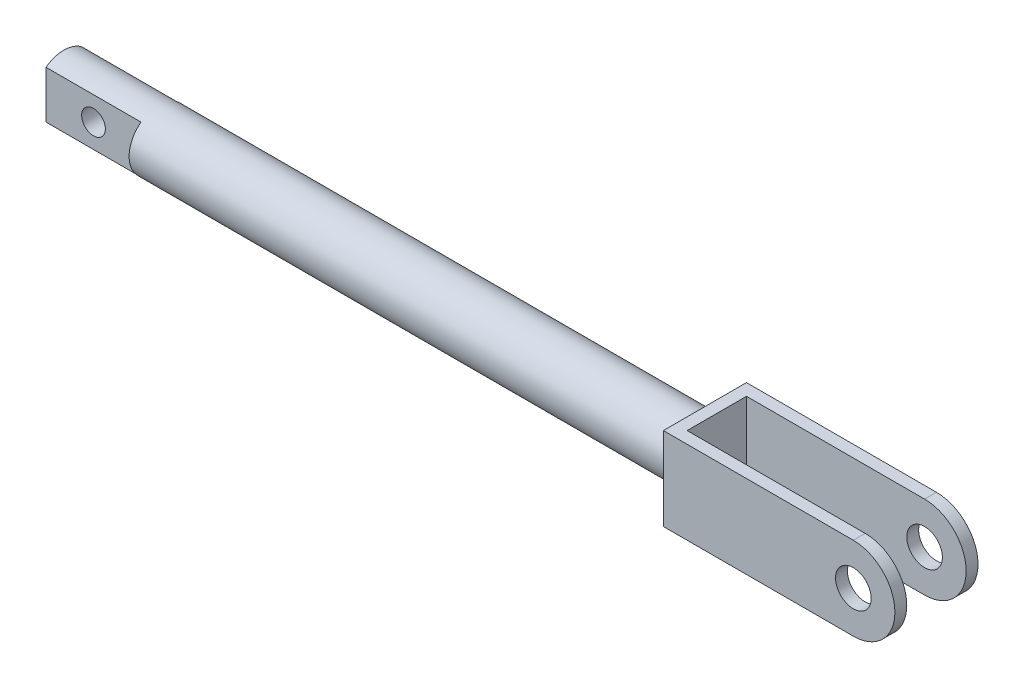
ISO-10303-21;
HEADER;
FILE_DESCRIPTION(('STEP AP214'),'2;1');
FILE_NAME('part.step','',(''),(''),'','','');
FILE_SCHEMA(('AUTOMOTIVE_DESIGN { 1 0 10303 214 1 1 1 1 }'));
ENDSEC;
DATA;
#1=APPLICATION_CONTEXT('core data for automotive mechanical design processes');
#2=APPLICATION_PROTOCOL_DEFINITION('international standard','automotive_design',2000,#1);
#3=PRODUCT_CONTEXT('',#1,'mechanical');
#4=PRODUCT('Part','Part','',(#3));
#5=PRODUCT_RELATED_PRODUCT_CATEGORY('part','',(#4));
#6=PRODUCT_DEFINITION_FORMATION('','',#4);
#7=PRODUCT_DEFINITION_CONTEXT('part definition',#1,'design');
#8=PRODUCT_DEFINITION('design','',#6,#7);
#9=PRODUCT_DEFINITION_SHAPE('','',#8);
#10=(LENGTH_UNIT() NAMED_UNIT(*) SI_UNIT(.MILLI.,.METRE.));
#11=(NAMED_UNIT(*) PLANE_ANGLE_UNIT() SI_UNIT($,.RADIAN.));
#12=(NAMED_UNIT(*) SI_UNIT($,.STERADIAN.) SOLID_ANGLE_UNIT());
#13=UNCERTAINTY_MEASURE_WITH_UNIT(LENGTH_MEASURE(1.E-05),#10,'distance_accuracy_value','');
#14=(GEOMETRIC_REPRESENTATION_CONTEXT(3) GLOBAL_UNCERTAINTY_ASSIGNED_CONTEXT((#13)) GLOBAL_UNIT_ASSIGNED_CONTEXT((#10,
#11,#12)) REPRESENTATION_CONTEXT('',''));
#15=CARTESIAN_POINT('',(0.,0.,0.));
#16=DIRECTION('',(0.,0.,1.));
#17=DIRECTION('',(1.,0.,0.));
#18=AXIS2_PLACEMENT_3D('',#15,#16,#17);
#19=CARTESIAN_POINT('',(330.,0.,17.5));
#20=DIRECTION('',(0.,0.,-0.999999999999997));
#21=DIRECTION('',(-1.,0.,0.));
#22=AXIS2_PLACEMENT_3D('',#19,#20,#21);
#23=CYLINDRICAL_SURFACE('',#22,17.5);
#24=DIRECTION('',(0.,0.,-0.999999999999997));
#25=VECTOR('',#24,1.);
#26=CARTESIAN_POINT('',(330.,17.5000000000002,17.5));
#27=LINE('',#26,#25);
#28=CARTESIAN_POINT('',(330.,17.5,-12.5));
#29=VERTEX_POINT('',#28);
#30=CARTESIAN_POINT('',(330.,17.5000000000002,-17.5));
#31=VERTEX_POINT('',#30);
#32=EDGE_CURVE('E211',#29,#31,#27,.T.);
#33=ORIENTED_EDGE('',*,*,#32,.F.);
#34=CARTESIAN_POINT('',(330.,0.,-12.5));
#35=DIRECTION('',(0.,0.,-0.999999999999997));
#36=DIRECTION('',(-1.,0.,0.));
#37=AXIS2_PLACEMENT_3D('',#34,#35,#36);
#38=CIRCLE('',#37,17.5);
#39=CARTESIAN_POINT('',(330.,-17.5,-12.5));
#40=VERTEX_POINT('',#39);
#41=EDGE_CURVE('E176',#29,#40,#38,.T.);
#42=ORIENTED_EDGE('',*,*,#41,.T.);
#43=DIRECTION('',(0.,0.,-0.999999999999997));
#44=VECTOR('',#43,1.);
#45=CARTESIAN_POINT('',(330.,-17.5,17.5));
#46=LINE('',#45,#44);
#47=CARTESIAN_POINT('',(330.,-17.5,-17.4999999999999));
#48=VERTEX_POINT('',#47);
#49=EDGE_CURVE('E215',#40,#48,#46,.T.);
#50=ORIENTED_EDGE('',*,*,#49,.T.);
#51=CARTESIAN_POINT('',(330.,0.,-17.5));
#52=DIRECTION('',(0.,0.,0.999999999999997));
#53=DIRECTION('',(-1.,0.,0.));
#54=AXIS2_PLACEMENT_3D('',#51,#52,#53);
#55=CIRCLE('',#54,17.5);
#56=EDGE_CURVE('E199',#48,#31,#55,.T.);
#57=ORIENTED_EDGE('',*,*,#56,.T.);
#58=EDGE_LOOP('',(#33,#42,#50,#57));
#59=FACE_BOUND('',#58,.T.);
#60=ADVANCED_FACE('F45',(#59),#23,.T.);
#61=CARTESIAN_POINT('',(330.,0.,17.5));
#62=DIRECTION('',(0.,0.,-0.999999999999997));
#63=DIRECTION('',(-1.,0.,0.));
#64=AXIS2_PLACEMENT_3D('',#61,#62,#63);
#65=CYLINDRICAL_SURFACE('',#64,7.50000000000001);
#66=CARTESIAN_POINT('',(330.,0.,-12.5));
#67=DIRECTION('',(0.,0.,-0.999999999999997));
#68=DIRECTION('',(-1.,0.,0.));
#69=AXIS2_PLACEMENT_3D('',#66,#67,#68);
#70=CIRCLE('',#69,7.50000000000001);
#71=CARTESIAN_POINT('',(322.5,0.,-12.5));
#72=VERTEX_POINT('',#71);
#73=EDGE_CURVE('E175',#72,#72,#70,.T.);
#74=CARTESIAN_POINT('',(330.,0.,-17.5));
#75=DIRECTION('',(0.,0.,0.999999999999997));
#76=DIRECTION('',(1.,0.,0.));
#77=AXIS2_PLACEMENT_3D('',#74,#75,#76);
#78=CIRCLE('',#77,7.50000000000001);
#79=CARTESIAN_POINT('',(322.5,0.,-17.5));
#80=VERTEX_POINT('',#79);
#81=EDGE_CURVE('E185',#80,#80,#78,.T.);
#82=CARTESIAN_POINT('',(322.5,0.,-12.5));
#83=CARTESIAN_POINT('',(322.5,0.,-12.5520833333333));
#84=CARTESIAN_POINT('',(322.5,0.,-12.6041666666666));
#85=CARTESIAN_POINT('',(322.5,0.,-12.7083333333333));
#86=CARTESIAN_POINT('',(322.5,0.,-12.7604166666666));
#87=CARTESIAN_POINT('',(322.5,0.,-12.8645833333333));
#88=CARTESIAN_POINT('',(322.5,0.,-12.9166666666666));
#89=CARTESIAN_POINT('',(322.5,0.,-13.0208333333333));
#90=CARTESIAN_POINT('',(322.5,0.,-13.0729166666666));
#91=CARTESIAN_POINT('',(322.5,0.,-13.1770833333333));
#92=CARTESIAN_POINT('',(322.5,0.,-13.2291666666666));
#93=CARTESIAN_POINT('',(322.5,0.,-13.3333333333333));
#94=CARTESIAN_POINT('',(322.5,0.,-13.3854166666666));
#95=CARTESIAN_POINT('',(322.5,0.,-13.4895833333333));
#96=CARTESIAN_POINT('',(322.5,0.,-13.5416666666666));
#97=CARTESIAN_POINT('',(322.5,0.,-13.6458333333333));
#98=CARTESIAN_POINT('',(322.5,0.,-13.6979166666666));
#99=CARTESIAN_POINT('',(322.5,0.,-13.8020833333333));
#100=CARTESIAN_POINT('',(322.5,0.,-13.8541666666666));
#101=CARTESIAN_POINT('',(322.5,0.,-13.9583333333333));
#102=CARTESIAN_POINT('',(322.5,0.,-14.0104166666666));
#103=CARTESIAN_POINT('',(322.5,0.,-14.1145833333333));
#104=CARTESIAN_POINT('',(322.5,0.,-14.1666666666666));
#105=CARTESIAN_POINT('',(322.5,0.,-14.2708333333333));
#106=CARTESIAN_POINT('',(322.5,0.,-14.3229166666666));
#107=CARTESIAN_POINT('',(322.5,0.,-14.4270833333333));
#108=CARTESIAN_POINT('',(322.5,0.,-14.4791666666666));
#109=CARTESIAN_POINT('',(322.5,0.,-14.5833333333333));
#110=CARTESIAN_POINT('',(322.5,0.,-14.6354166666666));
#111=CARTESIAN_POINT('',(322.5,0.,-14.7395833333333));
#112=CARTESIAN_POINT('',(322.5,0.,-14.7916666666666));
#113=CARTESIAN_POINT('',(322.5,0.,-14.8958333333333));
#114=CARTESIAN_POINT('',(322.5,0.,-14.9479166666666));
#115=CARTESIAN_POINT('',(322.5,0.,-15.0520833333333));
#116=CARTESIAN_POINT('',(322.5,0.,-15.1041666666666));
#117=CARTESIAN_POINT('',(322.5,0.,-15.2083333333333));
#118=CARTESIAN_POINT('',(322.5,0.,-15.2604166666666));
#119=CARTESIAN_POINT('',(322.5,0.,-15.3645833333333));
#120=CARTESIAN_POINT('',(322.5,0.,-15.4166666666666));
#121=CARTESIAN_POINT('',(322.5,0.,-15.5208333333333));
#122=CARTESIAN_POINT('',(322.5,0.,-15.5729166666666));
#123=CARTESIAN_POINT('',(322.5,0.,-15.6770833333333));
#124=CARTESIAN_POINT('',(322.5,0.,-15.7291666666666));
#125=CARTESIAN_POINT('',(322.5,0.,-15.8333333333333));
#126=CARTESIAN_POINT('',(322.5,0.,-15.8854166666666));
#127=CARTESIAN_POINT('',(322.5,0.,-15.9895833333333));
#128=CARTESIAN_POINT('',(322.5,0.,-16.0416666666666));
#129=CARTESIAN_POINT('',(322.5,0.,-16.1458333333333));
#130=CARTESIAN_POINT('',(322.5,0.,-16.1979166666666));
#131=CARTESIAN_POINT('',(322.5,0.,-16.3020833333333));
#132=CARTESIAN_POINT('',(322.5,0.,-16.3541666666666));
#133=CARTESIAN_POINT('',(322.5,0.,-16.4583333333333));
#134=CARTESIAN_POINT('',(322.5,0.,-16.5104166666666));
#135=CARTESIAN_POINT('',(322.5,0.,-16.6145833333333));
#136=CARTESIAN_POINT('',(322.5,0.,-16.6666666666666));
#137=CARTESIAN_POINT('',(322.5,0.,-16.7708333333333));
#138=CARTESIAN_POINT('',(322.5,0.,-16.8229166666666));
#139=CARTESIAN_POINT('',(322.5,0.,-16.9270833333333));
#140=CARTESIAN_POINT('',(322.5,0.,-16.9791666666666));
#141=CARTESIAN_POINT('',(322.5,0.,-17.0833333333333));
#142=CARTESIAN_POINT('',(322.5,0.,-17.1354166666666));
#143=CARTESIAN_POINT('',(322.5,0.,-17.2395833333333));
#144=CARTESIAN_POINT('',(322.5,0.,-17.2916666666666));
#145=CARTESIAN_POINT('',(322.5,0.,-17.3958333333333));
#146=CARTESIAN_POINT('',(322.5,0.,-17.4479166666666));
#147=CARTESIAN_POINT('',(322.5,0.,-17.5));
#148=B_SPLINE_CURVE_WITH_KNOTS('',3,(#82,#83,#84,#85,#86,#87,#88,#89,#90,#91,#92,#93,#94,#95,
#96,#97,#98,#99,#100,#101,#102,#103,#104,#105,#106,#107,#108,#109,#110,#111,#112,#113,#114,#115,
#116,#117,#118,#119,#120,#121,#122,#123,#124,#125,#126,#127,#128,#129,#130,#131,#132,#133,#134,
#135,#136,#137,#138,#139,#140,#141,#142,#143,#144,#145,#146,#147),.UNSPECIFIED.,.F.,.F.,(4,2,2,
2,2,2,2,2,2,2,2,2,2,2,2,2,2,2,2,2,2,2,2,2,2,2,2,2,2,2,2,2,4),(0.,0.15625,0.3125,0.46875,
0.624999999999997,0.781250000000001,0.937500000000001,1.09375,1.25,1.40625,1.5625,1.71875,
1.87500000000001,2.03125,2.18750000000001,2.34375,2.50000000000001,2.65625,2.8125,2.96875,3.125,
3.28125,3.4375,3.59375,3.75000000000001,3.90625,4.06250000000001,4.21875,4.37500000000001,
4.53125,4.68750000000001,4.84375000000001,5.00000000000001),.UNSPECIFIED.);
#149=EDGE_CURVE('BSEAM258',#72,#80,#148,.T.);
#150=ORIENTED_EDGE('',*,*,#73,.F.);
#151=ORIENTED_EDGE('',*,*,#81,.F.);
#152=ORIENTED_EDGE('',*,*,#149,.T.);
#153=ORIENTED_EDGE('',*,*,#149,.F.);
#154=EDGE_LOOP('',(#150,#152,#151,#153));
#155=FACE_BOUND('',#154,.T.);
#156=ADVANCED_FACE('F258',(#155),#65,.F.);
#157=CARTESIAN_POINT('',(250.,0.,0.));
#158=DIRECTION('',(-1.,0.,0.));
#159=DIRECTION('',(0.,0.,0.999999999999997));
#160=AXIS2_PLACEMENT_3D('',#157,#158,#159);
#161=CYLINDRICAL_SURFACE('',#160,12.5);
#162=CARTESIAN_POINT('',(250.,0.,0.));
#163=DIRECTION('',(1.,0.,0.));
#164=DIRECTION('',(0.,0.,-0.999999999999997));
#165=AXIS2_PLACEMENT_3D('',#162,#163,#164);
#166=CIRCLE('',#165,12.5);
#167=CARTESIAN_POINT('',(250.,0.,-12.5));
#168=VERTEX_POINT('',#167);
#169=EDGE_CURVE('E226',#168,#168,#166,.T.);
#170=ORIENTED_EDGE('',*,*,#169,.F.);
#171=EDGE_LOOP('',(#170));
#172=FACE_BOUND('',#171,.T.);
#173=CARTESIAN_POINT('',(-20.0000000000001,0.,0.));
#174=DIRECTION('',(1.,0.,0.));
#175=DIRECTION('',(0.,0.,-0.999999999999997));
#176=AXIS2_PLACEMENT_3D('',#173,#174,#175);
#177=CIRCLE('',#176,12.5);
#178=CARTESIAN_POINT('',(-20.,10.,-7.49999999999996));
#179=VERTEX_POINT('',#178);
#180=CARTESIAN_POINT('',(-20.,10.,7.5));
#181=VERTEX_POINT('',#180);
#182=EDGE_CURVE('E147',#179,#181,#177,.T.);
#183=ORIENTED_EDGE('',*,*,#182,.T.);
#184=DIRECTION('',(-1.,0.,0.));
#185=VECTOR('',#184,1.);
#186=CARTESIAN_POINT('',(250.,10.,7.50000000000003));
#187=LINE('',#186,#185);
#188=CARTESIAN_POINT('',(20.,10.,7.50000000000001));
#189=VERTEX_POINT('',#188);
#190=EDGE_CURVE('E60',#181,#189,#187,.F.);
#191=ORIENTED_EDGE('',*,*,#190,.T.);
#192=CARTESIAN_POINT('',(20.,0.,0.));
#193=DIRECTION('',(1.,0.,0.));
#194=DIRECTION('',(0.,0.,-0.999999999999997));
#195=AXIS2_PLACEMENT_3D('',#192,#193,#194);
#196=CIRCLE('',#195,12.5);
#197=CARTESIAN_POINT('',(20.,-10.,7.50000000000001));
#198=VERTEX_POINT('',#197);
#199=EDGE_CURVE('E13',#189,#198,#196,.T.);
#200=ORIENTED_EDGE('',*,*,#199,.T.);
#201=DIRECTION('',(-1.,0.,0.));
#202=VECTOR('',#201,1.);
#203=CARTESIAN_POINT('',(250.,-9.9999999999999,7.50000000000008));
#204=LINE('',#203,#202);
#205=CARTESIAN_POINT('',(-20.0000000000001,-9.99999999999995,7.49999999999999));
#206=VERTEX_POINT('',#205);
#207=EDGE_CURVE('E134',#198,#206,#204,.T.);
#208=ORIENTED_EDGE('',*,*,#207,.T.);
#209=CARTESIAN_POINT('',(-20.0000000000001,-9.99999999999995,-7.49999999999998));
#210=VERTEX_POINT('',#209);
#211=EDGE_CURVE('E68',#206,#210,#177,.T.);
#212=ORIENTED_EDGE('',*,*,#211,.T.);
#213=DIRECTION('',(-1.,0.,0.));
#214=VECTOR('',#213,1.);
#215=CARTESIAN_POINT('',(250.,-9.9999999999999,-7.50000000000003));
#216=LINE('',#215,#214);
#217=CARTESIAN_POINT('',(20.,-9.99999999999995,-7.5));
#218=VERTEX_POINT('',#217);
#219=EDGE_CURVE('E181',#210,#218,#216,.F.);
#220=ORIENTED_EDGE('',*,*,#219,.T.);
#221=CARTESIAN_POINT('',(20.,0.,0.));
#222=DIRECTION('',(1.,0.,0.));
#223=DIRECTION('',(0.,0.,-0.999999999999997));
#224=AXIS2_PLACEMENT_3D('',#221,#222,#223);
#225=CIRCLE('',#224,12.5);
#226=CARTESIAN_POINT('',(20.,10.,-7.49999999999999));
#227=VERTEX_POINT('',#226);
#228=EDGE_CURVE('E232',#218,#227,#225,.T.);
#229=ORIENTED_EDGE('',*,*,#228,.T.);
#230=DIRECTION('',(-1.,0.,0.));
#231=VECTOR('',#230,1.);
#232=CARTESIAN_POINT('',(250.,10.,-7.50000000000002));
#233=LINE('',#232,#231);
#234=EDGE_CURVE('E183',#227,#179,#233,.T.);
#235=ORIENTED_EDGE('',*,*,#234,.T.);
#236=EDGE_LOOP('',(#183,#191,#200,#208,#212,#220,#229,#235));
#237=FACE_BOUND('',#236,.T.);
#238=ADVANCED_FACE('F47',(#172,#237),#161,.T.);
#239=CARTESIAN_POINT('',(-20.0000000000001,0.,0.));
#240=DIRECTION('',(1.,0.,0.));
#241=DIRECTION('',(0.,0.,-0.999999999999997));
#242=AXIS2_PLACEMENT_3D('',#239,#240,#241);
#243=PLANE('',#242);
#244=ORIENTED_EDGE('',*,*,#211,.F.);
#245=DIRECTION('',(0.,1.,0.));
#246=VECTOR('',#245,1.);
#247=CARTESIAN_POINT('',(-20.0000000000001,0.,7.5));
#248=LINE('',#247,#246);
#249=EDGE_CURVE('E53',#206,#181,#248,.T.);
#250=ORIENTED_EDGE('',*,*,#249,.T.);
#251=ORIENTED_EDGE('',*,*,#182,.F.);
#252=DIRECTION('',(0.,-1.,0.));
#253=VECTOR('',#252,1.);
#254=CARTESIAN_POINT('',(-20.0000000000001,0.,-7.49999999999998));
#255=LINE('',#254,#253);
#256=EDGE_CURVE('E229',#179,#210,#255,.T.);
#257=ORIENTED_EDGE('',*,*,#256,.T.);
#258=EDGE_LOOP('',(#244,#250,#251,#257));
#259=FACE_BOUND('',#258,.T.);
#260=ADVANCED_FACE('F238',(#259),#243,.F.);
#261=CARTESIAN_POINT('',(250.,17.5000000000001,17.4999999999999));
#262=DIRECTION('',(1.,0.,0.));
#263=DIRECTION('',(0.,0.,-0.999999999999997));
#264=AXIS2_PLACEMENT_3D('',#261,#262,#263);
#265=PLANE('',#264);
#266=DIRECTION('',(0.,-1.,0.));
#267=VECTOR('',#266,1.);
#268=CARTESIAN_POINT('',(250.,17.5000000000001,-17.5));
#269=LINE('',#268,#267);
#270=CARTESIAN_POINT('',(250.,17.5000000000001,-17.5));
#271=VERTEX_POINT('',#270);
#272=CARTESIAN_POINT('',(250.,-17.5,-17.5));
#273=VERTEX_POINT('',#272);
#274=EDGE_CURVE('E194',#271,#273,#269,.T.);
#275=ORIENTED_EDGE('',*,*,#274,.T.);
#276=DIRECTION('',(0.,0.,-0.999999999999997));
#277=VECTOR('',#276,1.);
#278=CARTESIAN_POINT('',(250.,-17.5,17.5));
#279=LINE('',#278,#277);
#280=CARTESIAN_POINT('',(250.,-17.5,17.5));
#281=VERTEX_POINT('',#280);
#282=EDGE_CURVE('E219',#281,#273,#279,.T.);
#283=ORIENTED_EDGE('',*,*,#282,.F.);
#284=DIRECTION('',(0.,-1.,0.));
#285=VECTOR('',#284,1.);
#286=CARTESIAN_POINT('',(250.,17.5000000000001,17.4999999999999));
#287=LINE('',#286,#285);
#288=CARTESIAN_POINT('',(250.,17.5000000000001,17.4999999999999));
#289=VERTEX_POINT('',#288);
#290=EDGE_CURVE('E205',#289,#281,#287,.T.);
#291=ORIENTED_EDGE('',*,*,#290,.F.);
#292=DIRECTION('',(0.,0.,-0.999999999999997));
#293=VECTOR('',#292,1.);
#294=CARTESIAN_POINT('',(250.,17.5000000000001,17.4999999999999));
#295=LINE('',#294,#293);
#296=EDGE_CURVE('E222',#289,#271,#295,.T.);
#297=ORIENTED_EDGE('',*,*,#296,.T.);
#298=EDGE_LOOP('',(#275,#283,#291,#297));
#299=FACE_BOUND('',#298,.T.);
#300=ORIENTED_EDGE('',*,*,#169,.T.);
#301=EDGE_LOOP('',(#300));
#302=FACE_BOUND('',#301,.T.);
#303=ADVANCED_FACE('F308',(#299,#302),#265,.F.);
#304=CARTESIAN_POINT('',(330.,0.,17.5));
#305=DIRECTION('',(0.,0.,-0.999999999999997));
#306=DIRECTION('',(-1.,0.,0.));
#307=AXIS2_PLACEMENT_3D('',#304,#305,#306);
#308=PLANE('',#307);
#309=DIRECTION('',(-1.,0.,0.));
#310=VECTOR('',#309,1.);
#311=CARTESIAN_POINT('',(250.,17.5000000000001,17.4999999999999));
#312=LINE('',#311,#310);
#313=CARTESIAN_POINT('',(330.,17.5000000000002,17.5));
#314=VERTEX_POINT('',#313);
#315=EDGE_CURVE('E202',#314,#289,#312,.T.);
#316=ORIENTED_EDGE('',*,*,#315,.T.);
#317=ORIENTED_EDGE('',*,*,#290,.T.);
#318=DIRECTION('',(1.,0.,0.));
#319=VECTOR('',#318,1.);
#320=CARTESIAN_POINT('',(330.,-17.5,17.5));
#321=LINE('',#320,#319);
#322=CARTESIAN_POINT('',(330.,-17.5,17.5));
#323=VERTEX_POINT('',#322);
#324=EDGE_CURVE('E207',#281,#323,#321,.T.);
#325=ORIENTED_EDGE('',*,*,#324,.T.);
#326=CARTESIAN_POINT('',(330.,0.,17.5));
#327=DIRECTION('',(0.,0.,0.999999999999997));
#328=DIRECTION('',(-1.,0.,0.));
#329=AXIS2_PLACEMENT_3D('',#326,#327,#328);
#330=CIRCLE('',#329,17.5);
#331=EDGE_CURVE('E209',#323,#314,#330,.T.);
#332=ORIENTED_EDGE('',*,*,#331,.T.);
#333=EDGE_LOOP('',(#316,#317,#325,#332));
#334=FACE_BOUND('',#333,.T.);
#335=CARTESIAN_POINT('',(330.,0.,17.5));
#336=DIRECTION('',(0.,0.,0.999999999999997));
#337=DIRECTION('',(1.,0.,0.));
#338=AXIS2_PLACEMENT_3D('',#335,#336,#337);
#339=CIRCLE('',#338,7.50000000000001);
#340=CARTESIAN_POINT('',(322.5,0.,17.5));
#341=VERTEX_POINT('',#340);
#342=EDGE_CURVE('E188',#341,#341,#339,.T.);
#343=ORIENTED_EDGE('',*,*,#342,.F.);
#344=EDGE_LOOP('',(#343));
#345=FACE_BOUND('',#344,.T.);
#346=ADVANCED_FACE('F290',(#334,#345),#308,.F.);
#347=CARTESIAN_POINT('',(330.,0.,-17.5));
#348=DIRECTION('',(0.,0.,-0.999999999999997));
#349=DIRECTION('',(-1.,0.,0.));
#350=AXIS2_PLACEMENT_3D('',#347,#348,#349);
#351=PLANE('',#350);
#352=DIRECTION('',(-1.,0.,0.));
#353=VECTOR('',#352,1.);
#354=CARTESIAN_POINT('',(250.,17.5000000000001,-17.5));
#355=LINE('',#354,#353);
#356=EDGE_CURVE('E191',#31,#271,#355,.T.);
#357=ORIENTED_EDGE('',*,*,#356,.F.);
#358=ORIENTED_EDGE('',*,*,#56,.F.);
#359=DIRECTION('',(1.,0.,0.));
#360=VECTOR('',#359,1.);
#361=CARTESIAN_POINT('',(330.,-17.5,-17.4999999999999));
#362=LINE('',#361,#360);
#363=EDGE_CURVE('E196',#273,#48,#362,.T.);
#364=ORIENTED_EDGE('',*,*,#363,.F.);
#365=ORIENTED_EDGE('',*,*,#274,.F.);
#366=EDGE_LOOP('',(#357,#358,#364,#365));
#367=FACE_BOUND('',#366,.T.);
#368=ORIENTED_EDGE('',*,*,#81,.T.);
#369=EDGE_LOOP('',(#368));
#370=FACE_BOUND('',#369,.T.);
#371=ADVANCED_FACE('F305',(#367,#370),#351,.T.);
#372=CARTESIAN_POINT('',(250.,17.5000000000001,17.4999999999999));
#373=DIRECTION('',(0.,-1.,0.));
#374=DIRECTION('',(1.,0.,0.));
#375=AXIS2_PLACEMENT_3D('',#372,#373,#374);
#376=PLANE('',#375);
#377=DIRECTION('',(0.,0.,0.999999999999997));
#378=VECTOR('',#377,1.);
#379=CARTESIAN_POINT('',(255.000000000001,17.5000000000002,-12.5));
#380=LINE('',#379,#378);
#381=CARTESIAN_POINT('',(255.000000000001,17.5000000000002,-12.5));
#382=VERTEX_POINT('',#381);
#383=CARTESIAN_POINT('',(255.000000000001,17.5000000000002,12.5));
#384=VERTEX_POINT('',#383);
#385=EDGE_CURVE('E155',#382,#384,#380,.T.);
#386=ORIENTED_EDGE('',*,*,#385,.F.);
#387=DIRECTION('',(-1.,0.,0.));
#388=VECTOR('',#387,1.);
#389=CARTESIAN_POINT('',(330.,17.5,-12.5));
#390=LINE('',#389,#388);
#391=EDGE_CURVE('E153',#29,#382,#390,.T.);
#392=ORIENTED_EDGE('',*,*,#391,.F.);
#393=ORIENTED_EDGE('',*,*,#32,.T.);
#394=ORIENTED_EDGE('',*,*,#356,.T.);
#395=ORIENTED_EDGE('',*,*,#296,.F.);
#396=ORIENTED_EDGE('',*,*,#315,.F.);
#397=CARTESIAN_POINT('',(330.,17.5,12.5));
#398=VERTEX_POINT('',#397);
#399=EDGE_CURVE('E212',#314,#398,#27,.T.);
#400=ORIENTED_EDGE('',*,*,#399,.T.);
#401=DIRECTION('',(1.,0.,0.));
#402=VECTOR('',#401,1.);
#403=CARTESIAN_POINT('',(330.,17.5,12.5));
#404=LINE('',#403,#402);
#405=EDGE_CURVE('E138',#384,#398,#404,.T.);
#406=ORIENTED_EDGE('',*,*,#405,.F.);
#407=EDGE_LOOP('',(#386,#392,#393,#394,#395,#396,#400,#406));
#408=FACE_BOUND('',#407,.T.);
#409=ADVANCED_FACE('F276',(#408),#376,.F.);
#410=CARTESIAN_POINT('',(330.,-17.5,17.5));
#411=DIRECTION('',(0.,1.,0.));
#412=DIRECTION('',(-1.,0.,0.));
#413=AXIS2_PLACEMENT_3D('',#410,#411,#412);
#414=PLANE('',#413);
#415=ORIENTED_EDGE('',*,*,#49,.F.);
#416=DIRECTION('',(-1.,0.,0.));
#417=VECTOR('',#416,1.);
#418=CARTESIAN_POINT('',(347.5,-17.5,-12.5));
#419=LINE('',#418,#417);
#420=CARTESIAN_POINT('',(255.,-17.5,-12.5));
#421=VERTEX_POINT('',#420);
#422=EDGE_CURVE('E161',#40,#421,#419,.T.);
#423=ORIENTED_EDGE('',*,*,#422,.T.);
#424=DIRECTION('',(0.,0.,0.999999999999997));
#425=VECTOR('',#424,1.);
#426=CARTESIAN_POINT('',(255.,-17.5,-12.5));
#427=LINE('',#426,#425);
#428=CARTESIAN_POINT('',(255.,-17.5,12.5));
#429=VERTEX_POINT('',#428);
#430=EDGE_CURVE('E164',#421,#429,#427,.T.);
#431=ORIENTED_EDGE('',*,*,#430,.T.);
#432=DIRECTION('',(1.,0.,0.));
#433=VECTOR('',#432,1.);
#434=CARTESIAN_POINT('',(255.,-17.5,12.5));
#435=LINE('',#434,#433);
#436=CARTESIAN_POINT('',(330.,-17.5,12.5));
#437=VERTEX_POINT('',#436);
#438=EDGE_CURVE('E158',#429,#437,#435,.T.);
#439=ORIENTED_EDGE('',*,*,#438,.T.);
#440=EDGE_CURVE('E216',#323,#437,#46,.T.);
#441=ORIENTED_EDGE('',*,*,#440,.F.);
#442=ORIENTED_EDGE('',*,*,#324,.F.);
#443=ORIENTED_EDGE('',*,*,#282,.T.);
#444=ORIENTED_EDGE('',*,*,#363,.T.);
#445=EDGE_LOOP('',(#415,#423,#431,#439,#441,#442,#443,#444));
#446=FACE_BOUND('',#445,.T.);
#447=ADVANCED_FACE('F271',(#446),#414,.F.);
#448=CARTESIAN_POINT('',(330.,0.,12.5));
#449=DIRECTION('',(0.,0.,0.999999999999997));
#450=DIRECTION('',(1.,0.,0.));
#451=AXIS2_PLACEMENT_3D('',#448,#449,#450);
#452=CIRCLE('',#451,17.5);
#453=EDGE_CURVE('E173',#437,#398,#452,.T.);
#454=ORIENTED_EDGE('',*,*,#453,.T.);
#455=ORIENTED_EDGE('',*,*,#399,.F.);
#456=ORIENTED_EDGE('',*,*,#331,.F.);
#457=ORIENTED_EDGE('',*,*,#440,.T.);
#458=EDGE_LOOP('',(#454,#455,#456,#457));
#459=FACE_BOUND('',#458,.T.);
#460=ADVANCED_FACE('F255',(#459),#23,.T.);
#461=CARTESIAN_POINT('',(330.,0.,12.5));
#462=DIRECTION('',(0.,0.,0.999999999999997));
#463=DIRECTION('',(1.,0.,0.));
#464=AXIS2_PLACEMENT_3D('',#461,#462,#463);
#465=CIRCLE('',#464,7.50000000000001);
#466=CARTESIAN_POINT('',(322.5,0.,12.5));
#467=VERTEX_POINT('',#466);
#468=EDGE_CURVE('E170',#467,#467,#465,.T.);
#469=CARTESIAN_POINT('',(322.5,0.,12.5));
#470=CARTESIAN_POINT('',(322.5,0.,12.5520833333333));
#471=CARTESIAN_POINT('',(322.5,0.,12.6041666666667));
#472=CARTESIAN_POINT('',(322.5,0.,12.7083333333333));
#473=CARTESIAN_POINT('',(322.5,0.,12.7604166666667));
#474=CARTESIAN_POINT('',(322.5,0.,12.8645833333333));
#475=CARTESIAN_POINT('',(322.5,0.,12.9166666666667));
#476=CARTESIAN_POINT('',(322.5,0.,13.0208333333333));
#477=CARTESIAN_POINT('',(322.5,0.,13.0729166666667));
#478=CARTESIAN_POINT('',(322.5,0.,13.1770833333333));
#479=CARTESIAN_POINT('',(322.5,0.,13.2291666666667));
#480=CARTESIAN_POINT('',(322.5,0.,13.3333333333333));
#481=CARTESIAN_POINT('',(322.5,0.,13.3854166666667));
#482=CARTESIAN_POINT('',(322.5,0.,13.4895833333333));
#483=CARTESIAN_POINT('',(322.5,0.,13.5416666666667));
#484=CARTESIAN_POINT('',(322.5,0.,13.6458333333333));
#485=CARTESIAN_POINT('',(322.5,0.,13.6979166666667));
#486=CARTESIAN_POINT('',(322.5,0.,13.8020833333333));
#487=CARTESIAN_POINT('',(322.5,0.,13.8541666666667));
#488=CARTESIAN_POINT('',(322.5,0.,13.9583333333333));
#489=CARTESIAN_POINT('',(322.5,0.,14.0104166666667));
#490=CARTESIAN_POINT('',(322.5,0.,14.1145833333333));
#491=CARTESIAN_POINT('',(322.5,0.,14.1666666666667));
#492=CARTESIAN_POINT('',(322.5,0.,14.2708333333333));
#493=CARTESIAN_POINT('',(322.5,0.,14.3229166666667));
#494=CARTESIAN_POINT('',(322.5,0.,14.4270833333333));
#495=CARTESIAN_POINT('',(322.5,0.,14.4791666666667));
#496=CARTESIAN_POINT('',(322.5,0.,14.5833333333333));
#497=CARTESIAN_POINT('',(322.5,0.,14.6354166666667));
#498=CARTESIAN_POINT('',(322.5,0.,14.7395833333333));
#499=CARTESIAN_POINT('',(322.5,0.,14.7916666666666));
#500=CARTESIAN_POINT('',(322.5,0.,14.8958333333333));
#501=CARTESIAN_POINT('',(322.5,0.,14.9479166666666));
#502=CARTESIAN_POINT('',(322.5,0.,15.0520833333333));
#503=CARTESIAN_POINT('',(322.5,0.,15.1041666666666));
#504=CARTESIAN_POINT('',(322.5,0.,15.2083333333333));
#505=CARTESIAN_POINT('',(322.5,0.,15.2604166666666));
#506=CARTESIAN_POINT('',(322.5,0.,15.3645833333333));
#507=CARTESIAN_POINT('',(322.5,0.,15.4166666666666));
#508=CARTESIAN_POINT('',(322.5,0.,15.5208333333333));
#509=CARTESIAN_POINT('',(322.5,0.,15.5729166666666));
#510=CARTESIAN_POINT('',(322.5,0.,15.6770833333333));
#511=CARTESIAN_POINT('',(322.5,0.,15.7291666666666));
#512=CARTESIAN_POINT('',(322.5,0.,15.8333333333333));
#513=CARTESIAN_POINT('',(322.5,0.,15.8854166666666));
#514=CARTESIAN_POINT('',(322.5,0.,15.9895833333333));
#515=CARTESIAN_POINT('',(322.5,0.,16.0416666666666));
#516=CARTESIAN_POINT('',(322.5,0.,16.1458333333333));
#517=CARTESIAN_POINT('',(322.5,0.,16.1979166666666));
#518=CARTESIAN_POINT('',(322.5,0.,16.3020833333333));
#519=CARTESIAN_POINT('',(322.5,0.,16.3541666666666));
#520=CARTESIAN_POINT('',(322.5,0.,16.4583333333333));
#521=CARTESIAN_POINT('',(322.5,0.,16.5104166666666));
#522=CARTESIAN_POINT('',(322.5,0.,16.6145833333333));
#523=CARTESIAN_POINT('',(322.5,0.,16.6666666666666));
#524=CARTESIAN_POINT('',(322.5,0.,16.7708333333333));
#525=CARTESIAN_POINT('',(322.5,0.,16.8229166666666));
#526=CARTESIAN_POINT('',(322.5,0.,16.9270833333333));
#527=CARTESIAN_POINT('',(322.5,0.,16.9791666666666));
#528=CARTESIAN_POINT('',(322.5,0.,17.0833333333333));
#529=CARTESIAN_POINT('',(322.5,0.,17.1354166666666));
#530=CARTESIAN_POINT('',(322.5,0.,17.2395833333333));
#531=CARTESIAN_POINT('',(322.5,0.,17.2916666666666));
#532=CARTESIAN_POINT('',(322.5,0.,17.3958333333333));
#533=CARTESIAN_POINT('',(322.5,0.,17.4479166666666));
#534=CARTESIAN_POINT('',(322.5,0.,17.5));
#535=B_SPLINE_CURVE_WITH_KNOTS('',3,(#469,#470,#471,#472,#473,#474,#475,#476,#477,#478,#479,
#480,#481,#482,#483,#484,#485,#486,#487,#488,#489,#490,#491,#492,#493,#494,#495,#496,#497,#498,
#499,#500,#501,#502,#503,#504,#505,#506,#507,#508,#509,#510,#511,#512,#513,#514,#515,#516,#517,
#518,#519,#520,#521,#522,#523,#524,#525,#526,#527,#528,#529,#530,#531,#532,#533,#534),
.UNSPECIFIED.,.F.,.F.,(4,2,2,2,2,2,2,2,2,2,2,2,2,2,2,2,2,2,2,2,2,2,2,2,2,2,2,2,2,2,2,2,4),(0.,
0.156249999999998,0.312499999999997,0.468749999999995,0.624999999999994,0.781249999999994,
0.93749999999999,1.09374999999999,1.24999999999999,1.40624999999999,1.56249999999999,
1.71874999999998,1.87499999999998,2.03124999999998,2.18749999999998,2.34374999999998,
2.49999999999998,2.65624999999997,2.81249999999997,2.96874999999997,3.12499999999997,
3.28124999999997,3.43749999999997,3.59374999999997,3.74999999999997,3.90624999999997,
4.06249999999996,4.21874999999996,4.37499999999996,4.53124999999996,4.68749999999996,
4.84374999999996,4.99999999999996),.UNSPECIFIED.);
#536=EDGE_CURVE('BSEAM246',#467,#341,#535,.T.);
#537=ORIENTED_EDGE('',*,*,#468,.F.);
#538=ORIENTED_EDGE('',*,*,#342,.T.);
#539=ORIENTED_EDGE('',*,*,#536,.T.);
#540=ORIENTED_EDGE('',*,*,#536,.F.);
#541=EDGE_LOOP('',(#537,#539,#538,#540));
#542=FACE_BOUND('',#541,.T.);
#543=ADVANCED_FACE('F246',(#542),#65,.F.);
#544=CARTESIAN_POINT('',(20.,-17.5,-7.5));
#545=DIRECTION('',(1.,0.,0.));
#546=DIRECTION('',(0.,0.,-0.999999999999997));
#547=AXIS2_PLACEMENT_3D('',#544,#545,#546);
#548=PLANE('',#547);
#549=ORIENTED_EDGE('',*,*,#228,.F.);
#550=DIRECTION('',(0.,1.,0.));
#551=VECTOR('',#550,1.);
#552=CARTESIAN_POINT('',(20.,-17.5,-7.5));
#553=LINE('',#552,#551);
#554=EDGE_CURVE('E178',#218,#227,#553,.T.);
#555=ORIENTED_EDGE('',*,*,#554,.T.);
#556=EDGE_LOOP('',(#549,#555));
#557=FACE_BOUND('',#556,.T.);
#558=ADVANCED_FACE('F244',(#557),#548,.F.);
#559=CARTESIAN_POINT('',(-20.0000000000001,-17.5,-7.49999999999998));
#560=DIRECTION('',(0.,0.,0.999999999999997));
#561=DIRECTION('',(1.,0.,0.));
#562=AXIS2_PLACEMENT_3D('',#559,#560,#561);
#563=PLANE('',#562);
#564=CARTESIAN_POINT('',(0.,0.,-7.5));
#565=DIRECTION('',(0.,0.,0.999999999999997));
#566=DIRECTION('',(1.,0.,0.));
#567=AXIS2_PLACEMENT_3D('',#564,#565,#566);
#568=CIRCLE('',#567,5.);
#569=CARTESIAN_POINT('',(5.00000000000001,0.,-7.5));
#570=VERTEX_POINT('',#569);
#571=EDGE_CURVE('E142',#570,#570,#568,.T.);
#572=ORIENTED_EDGE('',*,*,#571,.T.);
#573=EDGE_LOOP('',(#572));
#574=FACE_BOUND('',#573,.T.);
#575=ORIENTED_EDGE('',*,*,#554,.F.);
#576=ORIENTED_EDGE('',*,*,#219,.F.);
#577=ORIENTED_EDGE('',*,*,#256,.F.);
#578=ORIENTED_EDGE('',*,*,#234,.F.);
#579=EDGE_LOOP('',(#575,#576,#577,#578));
#580=FACE_BOUND('',#579,.T.);
#581=ADVANCED_FACE('F242',(#574,#580),#563,.F.);
#582=CARTESIAN_POINT('',(330.,-17.5,-12.5));
#583=DIRECTION('',(0.,0.,-0.999999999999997));
#584=DIRECTION('',(-1.,0.,0.));
#585=AXIS2_PLACEMENT_3D('',#582,#583,#584);
#586=PLANE('',#585);
#587=ORIENTED_EDGE('',*,*,#73,.T.);
#588=EDGE_LOOP('',(#587));
#589=FACE_BOUND('',#588,.T.);
#590=ORIENTED_EDGE('',*,*,#391,.T.);
#591=DIRECTION('',(0.,1.,0.));
#592=VECTOR('',#591,1.);
#593=CARTESIAN_POINT('',(255.,-17.5,-12.5));
#594=LINE('',#593,#592);
#595=EDGE_CURVE('E167',#421,#382,#594,.T.);
#596=ORIENTED_EDGE('',*,*,#595,.F.);
#597=ORIENTED_EDGE('',*,*,#422,.F.);
#598=ORIENTED_EDGE('',*,*,#41,.F.);
#599=EDGE_LOOP('',(#590,#596,#597,#598));
#600=FACE_BOUND('',#599,.T.);
#601=ADVANCED_FACE('F252',(#589,#600),#586,.F.);
#602=CARTESIAN_POINT('',(330.,-17.5,12.5));
#603=DIRECTION('',(0.,0.,0.999999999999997));
#604=DIRECTION('',(1.,0.,0.));
#605=AXIS2_PLACEMENT_3D('',#602,#603,#604);
#606=PLANE('',#605);
#607=ORIENTED_EDGE('',*,*,#468,.T.);
#608=EDGE_LOOP('',(#607));
#609=FACE_BOUND('',#608,.T.);
#610=ORIENTED_EDGE('',*,*,#453,.F.);
#611=ORIENTED_EDGE('',*,*,#438,.F.);
#612=DIRECTION('',(0.,1.,0.));
#613=VECTOR('',#612,1.);
#614=CARTESIAN_POINT('',(255.,-17.5,12.5));
#615=LINE('',#614,#613);
#616=EDGE_CURVE('E168',#429,#384,#615,.T.);
#617=ORIENTED_EDGE('',*,*,#616,.T.);
#618=ORIENTED_EDGE('',*,*,#405,.T.);
#619=EDGE_LOOP('',(#610,#611,#617,#618));
#620=FACE_BOUND('',#619,.T.);
#621=ADVANCED_FACE('F285',(#609,#620),#606,.F.);
#622=CARTESIAN_POINT('',(255.,-17.5,-12.5));
#623=DIRECTION('',(-1.,0.,0.));
#624=DIRECTION('',(0.,-1.,0.));
#625=AXIS2_PLACEMENT_3D('',#622,#623,#624);
#626=PLANE('',#625);
#627=ORIENTED_EDGE('',*,*,#385,.T.);
#628=ORIENTED_EDGE('',*,*,#616,.F.);
#629=ORIENTED_EDGE('',*,*,#430,.F.);
#630=ORIENTED_EDGE('',*,*,#595,.T.);
#631=EDGE_LOOP('',(#627,#628,#629,#630));
#632=FACE_BOUND('',#631,.T.);
#633=ADVANCED_FACE('F298',(#632),#626,.F.);
#634=CARTESIAN_POINT('',(20.,-17.5,7.50000000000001));
#635=DIRECTION('',(1.,0.,0.));
#636=DIRECTION('',(0.,0.,-0.999999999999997));
#637=AXIS2_PLACEMENT_3D('',#634,#635,#636);
#638=PLANE('',#637);
#639=DIRECTION('',(0.,1.,0.));
#640=VECTOR('',#639,1.);
#641=CARTESIAN_POINT('',(20.,-17.5,7.50000000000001));
#642=LINE('',#641,#640);
#643=EDGE_CURVE('E137',#198,#189,#642,.T.);
#644=ORIENTED_EDGE('',*,*,#643,.F.);
#645=ORIENTED_EDGE('',*,*,#199,.F.);
#646=EDGE_LOOP('',(#644,#645));
#647=FACE_BOUND('',#646,.T.);
#648=ADVANCED_FACE('F141',(#647),#638,.F.);
#649=CARTESIAN_POINT('',(-20.0000000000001,-17.5,7.49999999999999));
#650=DIRECTION('',(0.,0.,-0.999999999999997));
#651=DIRECTION('',(-1.,0.,0.));
#652=AXIS2_PLACEMENT_3D('',#649,#650,#651);
#653=PLANE('',#652);
#654=CARTESIAN_POINT('',(0.,0.,7.5));
#655=DIRECTION('',(0.,0.,0.999999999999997));
#656=DIRECTION('',(1.,0.,0.));
#657=AXIS2_PLACEMENT_3D('',#654,#655,#656);
#658=CIRCLE('',#657,5.);
#659=CARTESIAN_POINT('',(5.00000000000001,0.,7.5));
#660=VERTEX_POINT('',#659);
#661=EDGE_CURVE('E416',#660,#660,#658,.T.);
#662=ORIENTED_EDGE('',*,*,#661,.F.);
#663=EDGE_LOOP('',(#662));
#664=FACE_BOUND('',#663,.T.);
#665=ORIENTED_EDGE('',*,*,#643,.T.);
#666=ORIENTED_EDGE('',*,*,#190,.F.);
#667=ORIENTED_EDGE('',*,*,#249,.F.);
#668=ORIENTED_EDGE('',*,*,#207,.F.);
#669=EDGE_LOOP('',(#665,#666,#667,#668));
#670=FACE_BOUND('',#669,.T.);
#671=ADVANCED_FACE('F136',(#664,#670),#653,.F.);
#672=CARTESIAN_POINT('',(0.,0.,-17.5));
#673=DIRECTION('',(0.,0.,0.999999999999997));
#674=DIRECTION('',(1.,0.,0.));
#675=AXIS2_PLACEMENT_3D('',#672,#673,#674);
#676=CYLINDRICAL_SURFACE('',#675,5.);
#677=CARTESIAN_POINT('',(5.00000000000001,0.,7.5));
#678=CARTESIAN_POINT('',(5.00000000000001,0.,7.34375));
#679=CARTESIAN_POINT('',(5.00000000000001,0.,7.1875));
#680=CARTESIAN_POINT('',(5.00000000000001,0.,6.875));
#681=CARTESIAN_POINT('',(5.00000000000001,0.,6.71875));
#682=CARTESIAN_POINT('',(5.00000000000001,0.,6.40625));
#683=CARTESIAN_POINT('',(5.00000000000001,0.,6.25));
#684=CARTESIAN_POINT('',(5.00000000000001,0.,5.9375));
#685=CARTESIAN_POINT('',(5.00000000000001,0.,5.78125));
#686=CARTESIAN_POINT('',(5.00000000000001,0.,5.46875));
#687=CARTESIAN_POINT('',(5.00000000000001,0.,5.3125));
#688=CARTESIAN_POINT('',(5.00000000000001,0.,5.));
#689=CARTESIAN_POINT('',(5.00000000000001,0.,4.84375));
#690=CARTESIAN_POINT('',(5.00000000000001,0.,4.53125));
#691=CARTESIAN_POINT('',(5.00000000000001,0.,4.375));
#692=CARTESIAN_POINT('',(5.00000000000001,0.,4.0625));
#693=CARTESIAN_POINT('',(5.00000000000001,0.,3.90625));
#694=CARTESIAN_POINT('',(5.00000000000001,0.,3.59375));
#695=CARTESIAN_POINT('',(5.00000000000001,0.,3.4375));
#696=CARTESIAN_POINT('',(5.00000000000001,0.,3.125));
#697=CARTESIAN_POINT('',(5.00000000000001,0.,2.96875));
#698=CARTESIAN_POINT('',(5.00000000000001,0.,2.65625));
#699=CARTESIAN_POINT('',(5.00000000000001,0.,2.5));
#700=CARTESIAN_POINT('',(5.00000000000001,0.,2.1875));
#701=CARTESIAN_POINT('',(5.00000000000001,0.,2.03125));
#702=CARTESIAN_POINT('',(5.00000000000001,0.,1.71875));
#703=CARTESIAN_POINT('',(5.00000000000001,0.,1.5625));
#704=CARTESIAN_POINT('',(5.00000000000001,0.,1.25));
#705=CARTESIAN_POINT('',(5.00000000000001,0.,1.09375));
#706=CARTESIAN_POINT('',(5.00000000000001,0.,0.781250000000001));
#707=CARTESIAN_POINT('',(5.00000000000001,0.,0.625000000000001));
#708=CARTESIAN_POINT('',(5.00000000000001,0.,0.312500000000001));
#709=CARTESIAN_POINT('',(5.00000000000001,0.,0.156250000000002));
#710=CARTESIAN_POINT('',(5.00000000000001,0.,-0.156249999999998));
#711=CARTESIAN_POINT('',(5.00000000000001,0.,-0.312499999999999));
#712=CARTESIAN_POINT('',(5.00000000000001,0.,-0.625000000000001));
#713=CARTESIAN_POINT('',(5.00000000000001,0.,-0.781250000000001));
#714=CARTESIAN_POINT('',(5.00000000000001,0.,-1.09375));
#715=CARTESIAN_POINT('',(5.00000000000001,0.,-1.25));
#716=CARTESIAN_POINT('',(5.00000000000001,0.,-1.5625));
#717=CARTESIAN_POINT('',(5.00000000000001,0.,-1.71875));
#718=CARTESIAN_POINT('',(5.00000000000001,0.,-2.03125));
#719=CARTESIAN_POINT('',(5.00000000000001,0.,-2.1875));
#720=CARTESIAN_POINT('',(5.00000000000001,0.,-2.5));
#721=CARTESIAN_POINT('',(5.00000000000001,0.,-2.65625));
#722=CARTESIAN_POINT('',(5.00000000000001,0.,-2.96875));
#723=CARTESIAN_POINT('',(5.00000000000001,0.,-3.125));
#724=CARTESIAN_POINT('',(5.00000000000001,0.,-3.4375));
#725=CARTESIAN_POINT('',(5.00000000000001,0.,-3.59375));
#726=CARTESIAN_POINT('',(5.00000000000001,0.,-3.90625));
#727=CARTESIAN_POINT('',(5.00000000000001,0.,-4.0625));
#728=CARTESIAN_POINT('',(5.00000000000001,0.,-4.375));
#729=CARTESIAN_POINT('',(5.00000000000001,0.,-4.53125));
#730=CARTESIAN_POINT('',(5.00000000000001,0.,-4.84375));
#731=CARTESIAN_POINT('',(5.00000000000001,0.,-5.));
#732=CARTESIAN_POINT('',(5.00000000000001,0.,-5.3125));
#733=CARTESIAN_POINT('',(5.00000000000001,0.,-5.46875));
#734=CARTESIAN_POINT('',(5.00000000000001,0.,-5.78125));
#735=CARTESIAN_POINT('',(5.00000000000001,0.,-5.9375));
#736=CARTESIAN_POINT('',(5.00000000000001,0.,-6.25));
#737=CARTESIAN_POINT('',(5.00000000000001,0.,-6.40625));
#738=CARTESIAN_POINT('',(5.00000000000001,0.,-6.71875));
#739=CARTESIAN_POINT('',(5.00000000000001,0.,-6.875));
#740=CARTESIAN_POINT('',(5.00000000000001,0.,-7.1875));
#741=CARTESIAN_POINT('',(5.00000000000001,0.,-7.34375));
#742=CARTESIAN_POINT('',(5.00000000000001,0.,-7.5));
#743=B_SPLINE_CURVE_WITH_KNOTS('',3,(#677,#678,#679,#680,#681,#682,#683,#684,#685,#686,#687,
#688,#689,#690,#691,#692,#693,#694,#695,#696,#697,#698,#699,#700,#701,#702,#703,#704,#705,#706,
#707,#708,#709,#710,#711,#712,#713,#714,#715,#716,#717,#718,#719,#720,#721,#722,#723,#724,#725,
#726,#727,#728,#729,#730,#731,#732,#733,#734,#735,#736,#737,#738,#739,#740,#741,#742),
.UNSPECIFIED.,.F.,.F.,(4,2,2,2,2,2,2,2,2,2,2,2,2,2,2,2,2,2,2,2,2,2,2,2,2,2,2,2,2,2,2,2,4),(0.,
0.46875,0.937500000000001,1.40625,1.875,2.34375,2.8125,3.28125,3.75,4.21875,4.6875,5.15625,
5.62500000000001,6.09375000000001,6.5625,7.03125,7.5,7.96875,8.4375,8.90625,9.37500000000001,
9.84375,10.3125,10.78125,11.25,11.71875,12.1875,12.65625,13.125,13.59375,14.0625,14.53125,15.),.UNSPECIFIED.);
#744=EDGE_CURVE('BSEAM403',#660,#570,#743,.T.);
#745=ORIENTED_EDGE('',*,*,#661,.T.);
#746=ORIENTED_EDGE('',*,*,#571,.F.);
#747=ORIENTED_EDGE('',*,*,#744,.T.);
#748=ORIENTED_EDGE('',*,*,#744,.F.);
#749=EDGE_LOOP('',(#745,#747,#746,#748));
#750=FACE_BOUND('',#749,.T.);
#751=ADVANCED_FACE('F403',(#750),#676,.F.);
#752=CLOSED_SHELL('',(#60,#156,#238,#260,#303,#346,#371,#409,#447,#460,#543,#558,#581,#601,#621,
#633,#648,#671,#751));
#753=MANIFOLD_SOLID_BREP('B2',#752);
#754=ADVANCED_BREP_SHAPE_REPRESENTATION('',(#18,#753),#14);
#755=SHAPE_DEFINITION_REPRESENTATION(#9,#754);
ENDSEC;
END-ISO-10303-21;
